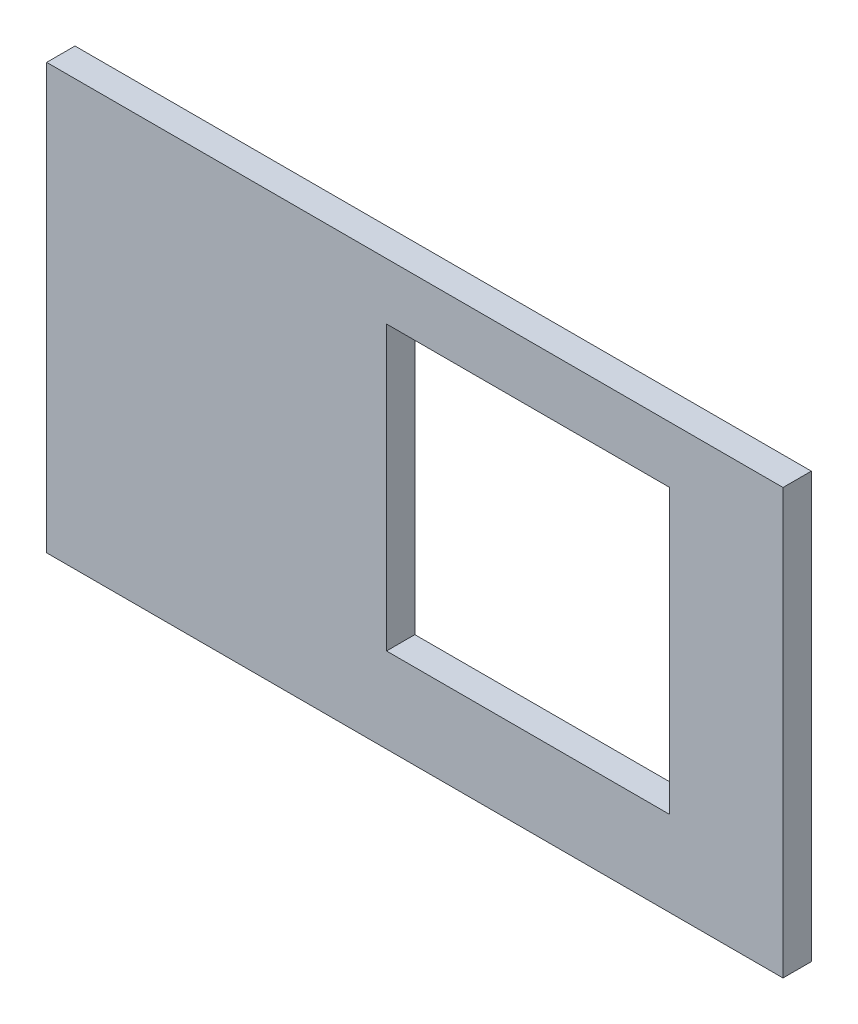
from build123d import *

# Parameters (mm, degrees)
ESQUISSE1_W          = 52
ESQUISSE1_H          = 30
ESQUISSE1_W_2        = 20
ESQUISSE1_H_2        = 20
BASE_EXTRUSION_DEPTH = 2


with BuildPart() as part:
    # Esquisse1 → Base-Extrusion (new body)
    with BuildSketch(Plane.XY):
        with Locations((26, 15)):
            Rectangle(ESQUISSE1_W, ESQUISSE1_H)
        with Locations((34, 16)):
            Rectangle(ESQUISSE1_W_2, ESQUISSE1_H_2, mode=Mode.SUBTRACT)
    extrude(amount=BASE_EXTRUSION_DEPTH)


solid = part.part
